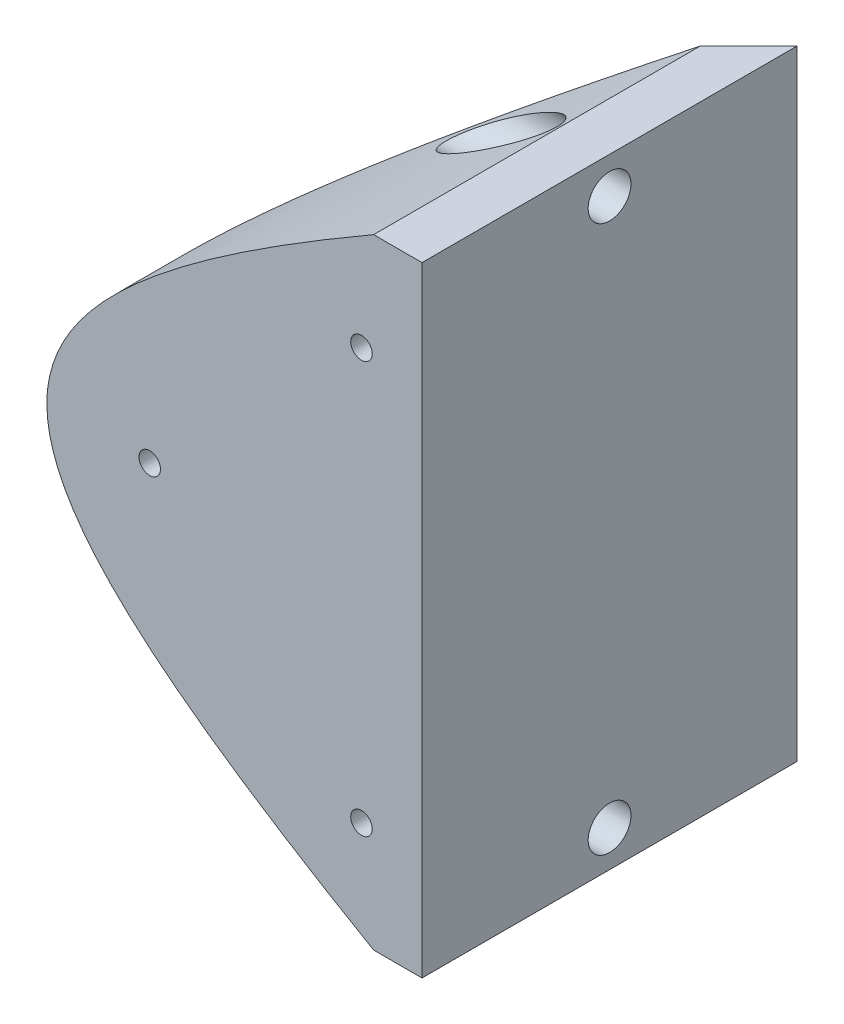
ISO-10303-21;
HEADER;
FILE_DESCRIPTION(('STEP AP214'),'2;1');
FILE_NAME('part.step','',(''),(''),'','','');
FILE_SCHEMA(('AUTOMOTIVE_DESIGN { 1 0 10303 214 1 1 1 1 }'));
ENDSEC;
DATA;
#1=APPLICATION_CONTEXT('core data for automotive mechanical design processes');
#2=APPLICATION_PROTOCOL_DEFINITION('international standard','automotive_design',2000,#1);
#3=PRODUCT_CONTEXT('',#1,'mechanical');
#4=PRODUCT('Part','Part','',(#3));
#5=PRODUCT_RELATED_PRODUCT_CATEGORY('part','',(#4));
#6=PRODUCT_DEFINITION_FORMATION('','',#4);
#7=PRODUCT_DEFINITION_CONTEXT('part definition',#1,'design');
#8=PRODUCT_DEFINITION('design','',#6,#7);
#9=PRODUCT_DEFINITION_SHAPE('','',#8);
#10=(LENGTH_UNIT() NAMED_UNIT(*) SI_UNIT(.MILLI.,.METRE.));
#11=(NAMED_UNIT(*) PLANE_ANGLE_UNIT() SI_UNIT($,.RADIAN.));
#12=(NAMED_UNIT(*) SI_UNIT($,.STERADIAN.) SOLID_ANGLE_UNIT());
#13=UNCERTAINTY_MEASURE_WITH_UNIT(LENGTH_MEASURE(1.E-05),#10,'distance_accuracy_value','');
#14=(GEOMETRIC_REPRESENTATION_CONTEXT(3) GLOBAL_UNCERTAINTY_ASSIGNED_CONTEXT((#13)) GLOBAL_UNIT_ASSIGNED_CONTEXT((#10,
#11,#12)) REPRESENTATION_CONTEXT('',''));
#15=CARTESIAN_POINT('',(0.,0.,0.));
#16=DIRECTION('',(0.,0.,1.));
#17=DIRECTION('',(1.,0.,0.));
#18=AXIS2_PLACEMENT_3D('',#15,#16,#17);
#19=CARTESIAN_POINT('',(-5.08,32.512,-39.37));
#20=CARTESIAN_POINT('',(-61.3924358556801,0.,-39.37));
#21=CARTESIAN_POINT('',(-5.08,-32.512,-39.37));
#22=(BOUNDED_CURVE() B_SPLINE_CURVE(2,(#19,#20,#21),.UNSPECIFIED.,.F.,
.F.) B_SPLINE_CURVE_WITH_KNOTS((3,3),(0.,1.),
.UNSPECIFIED.) CURVE() GEOMETRIC_REPRESENTATION_ITEM() RATIONAL_B_SPLINE_CURVE((1.,
1.5570484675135,1.)) REPRESENTATION_ITEM(''));
#23=DIRECTION('',(0.,0.,1.));
#24=VECTOR('',#23,1.);
#25=SURFACE_OF_LINEAR_EXTRUSION('',#22,#24);
#26=CARTESIAN_POINT('',(-5.08,32.512,-34.2900000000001));
#27=CARTESIAN_POINT('',(-5.67045751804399,32.1710885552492,-33.6995424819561));
#28=CARTESIAN_POINT('',(-6.26037439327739,31.8282982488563,-33.1096256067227));
#29=CARTESIAN_POINT('',(-7.4396270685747,31.1382006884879,-31.9303729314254));
#30=CARTESIAN_POINT('',(-8.028961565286,30.7908889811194,-31.3410384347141));
#31=CARTESIAN_POINT('',(-9.20676623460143,30.0914317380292,-30.1632337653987));
#32=CARTESIAN_POINT('',(-9.79523529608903,29.7392824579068,-29.5747647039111));
#33=CARTESIAN_POINT('',(-10.9710030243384,29.0297612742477,-28.3989969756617));
#34=CARTESIAN_POINT('',(-11.5583008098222,28.6723864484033,-27.811699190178));
#35=CARTESIAN_POINT('',(-12.7313999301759,27.9519577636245,-26.6386000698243));
#36=CARTESIAN_POINT('',(-13.3172006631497,27.5889019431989,-26.0527993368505));
#37=CARTESIAN_POINT('',(-14.4869529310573,26.8565669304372,-24.8830470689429));
#38=CARTESIAN_POINT('',(-15.0709041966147,26.4872868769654,-24.2990958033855));
#39=CARTESIAN_POINT('',(-16.2627289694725,25.725126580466,-23.1072710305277));
#40=CARTESIAN_POINT('',(-16.8705015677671,25.3319304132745,-22.4994984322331));
#41=CARTESIAN_POINT('',(-18.0831584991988,24.5371111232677,-21.2868415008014));
#42=CARTESIAN_POINT('',(-18.6880433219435,24.1354894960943,-20.6819566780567));
#43=CARTESIAN_POINT('',(-19.8943868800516,23.3227063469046,-19.4756131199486));
#44=CARTESIAN_POINT('',(-20.4958465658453,22.9115476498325,-18.874153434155));
#45=CARTESIAN_POINT('',(-21.6947124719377,22.0783163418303,-17.6752875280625));
#46=CARTESIAN_POINT('',(-22.2921200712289,21.6562477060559,-17.0778799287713));
#47=CARTESIAN_POINT('',(-23.4821313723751,20.7994742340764,-15.8878686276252));
#48=CARTESIAN_POINT('',(-24.0747366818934,20.3647738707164,-15.2952633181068));
#49=CARTESIAN_POINT('',(-25.2542431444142,19.480543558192,-14.115756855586));
#50=CARTESIAN_POINT('',(-25.8411455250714,19.031016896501,-13.5288544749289));
#51=CARTESIAN_POINT('',(-26.7711174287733,18.3004241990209,-12.5988825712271));
#52=CARTESIAN_POINT('',(-27.1164317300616,18.0250686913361,-12.2535682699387));
#53=CARTESIAN_POINT('',(-27.8042829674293,17.467394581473,-11.565717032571));
#54=CARTESIAN_POINT('',(-28.1468196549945,17.1850753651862,-11.2231803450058));
#55=CARTESIAN_POINT('',(-28.828740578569,16.6126037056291,-10.5412594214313));
#56=CARTESIAN_POINT('',(-29.1681238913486,16.3224490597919,-10.2018761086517));
#57=CARTESIAN_POINT('',(-29.8432860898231,15.7332499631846,-9.52671391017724));
#58=CARTESIAN_POINT('',(-30.179062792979,15.4342005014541,-9.19093720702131));
#59=CARTESIAN_POINT('',(-30.8464602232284,14.825919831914,-8.52353977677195));
#60=CARTESIAN_POINT('',(-31.1780764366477,14.5166786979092,-8.19192356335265));
#61=CARTESIAN_POINT('',(-31.8326010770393,13.8901080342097,-7.53739892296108));
#62=CARTESIAN_POINT('',(-32.1555636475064,13.5728919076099,-7.21443635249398));
#63=CARTESIAN_POINT('',(-32.7951323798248,12.925780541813,-6.57486762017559));
#64=CARTESIAN_POINT('',(-33.1117380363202,12.5958843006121,-6.25826196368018));
#65=CARTESIAN_POINT('',(-33.7368367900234,11.9217807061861,-5.63316320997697));
#66=CARTESIAN_POINT('',(-34.0453366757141,11.577585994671,-5.32466332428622));
#67=CARTESIAN_POINT('',(-34.6521610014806,10.8727103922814,-4.71783899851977));
#68=CARTESIAN_POINT('',(-34.9504978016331,10.5120508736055,-4.4195021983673));
#69=CARTESIAN_POINT('',(-35.5345343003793,9.77125982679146,-3.83546569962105));
#70=CARTESIAN_POINT('',(-35.8202432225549,9.39114296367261,-3.54975677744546));
#71=CARTESIAN_POINT('',(-36.3061651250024,8.70560316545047,-3.06383487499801));
#72=CARTESIAN_POINT('',(-36.5099200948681,8.405214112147,-2.86007990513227));
#73=CARTESIAN_POINT('',(-36.906185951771,7.78976028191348,-2.46381404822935));
#74=CARTESIAN_POINT('',(-37.0986945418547,7.47469253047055,-2.27130545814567));
#75=CARTESIAN_POINT('',(-37.4693990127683,6.82860349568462,-1.90060098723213));
#76=CARTESIAN_POINT('',(-37.6476115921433,6.49760156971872,-1.72238840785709));
#77=CARTESIAN_POINT('',(-37.9861994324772,5.81802785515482,-1.38380056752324));
#78=CARTESIAN_POINT('',(-38.1465819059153,5.4694632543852,-1.2234180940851));
#79=CARTESIAN_POINT('',(-38.5026177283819,4.61496994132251,-0.867382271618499));
#80=CARTESIAN_POINT('',(-38.6880553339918,4.10015015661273,-0.681944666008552));
#81=CARTESIAN_POINT('',(-38.9221371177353,3.30258699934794,-0.447862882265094));
#82=CARTESIAN_POINT('',(-38.9928006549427,3.0326146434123,-0.377199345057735));
#83=CARTESIAN_POINT('',(-39.1174690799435,2.48501306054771,-0.252530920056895));
#84=CARTESIAN_POINT('',(-39.171477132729,2.20738529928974,-0.198522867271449));
#85=CARTESIAN_POINT('',(-39.2543657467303,1.68750199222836,-0.115634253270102));
#86=CARTESIAN_POINT('',(-39.2857739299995,1.44605069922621,-0.0842260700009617));
#87=CARTESIAN_POINT('',(-39.3342056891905,0.960271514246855,-0.0357943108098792));
#88=CARTESIAN_POINT('',(-39.3512307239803,0.715943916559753,-0.0187692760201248));
#89=CARTESIAN_POINT('',(-39.3703637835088,0.226185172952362,0.000363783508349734));
#90=CARTESIAN_POINT('',(-39.372475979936,-0.0192456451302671,0.00247597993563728));
#91=CARTESIAN_POINT('',(-39.3617275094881,-0.509453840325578,-0.00827249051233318));
#92=CARTESIAN_POINT('',(-39.3488663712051,-0.754231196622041,-0.021133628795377));
#93=CARTESIAN_POINT('',(-39.3086313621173,-1.24069193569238,-0.0613686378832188));
#94=CARTESIAN_POINT('',(-39.2812971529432,-1.48238193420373,-0.0887028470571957));
#95=CARTESIAN_POINT('',(-39.2129460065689,-1.96183019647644,-0.157053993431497));
#96=CARTESIAN_POINT('',(-39.1719291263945,-2.19958847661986,-0.198070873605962));
#97=CARTESIAN_POINT('',(-39.0772802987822,-2.67009758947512,-0.29271970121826));
#98=CARTESIAN_POINT('',(-39.0236432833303,-2.90284636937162,-0.346356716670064));
#99=CARTESIAN_POINT('',(-38.904993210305,-3.36246357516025,-0.465006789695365));
#100=CARTESIAN_POINT('',(-38.8399787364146,-3.58933126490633,-0.530021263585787));
#101=CARTESIAN_POINT('',(-38.6935539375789,-4.05678861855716,-0.676446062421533));
#102=CARTESIAN_POINT('',(-38.6111957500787,-4.29678222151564,-0.758804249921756));
#103=CARTESIAN_POINT('',(-38.4360047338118,-4.76911927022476,-0.933995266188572));
#104=CARTESIAN_POINT('',(-38.3431660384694,-5.00145833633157,-1.02683396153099));
#105=CARTESIAN_POINT('',(-38.1484593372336,-5.45846839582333,-1.22154066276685));
#106=CARTESIAN_POINT('',(-38.0465895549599,-5.68313786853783,-1.32341044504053));
#107=CARTESIAN_POINT('',(-37.8347357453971,-6.12576022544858,-1.53526425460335));
#108=CARTESIAN_POINT('',(-37.7247256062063,-6.34368800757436,-1.64527439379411));
#109=CARTESIAN_POINT('',(-37.4980172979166,-6.77234325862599,-1.87198270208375));
#110=CARTESIAN_POINT('',(-37.381321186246,-6.98307291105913,-1.98867881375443));
#111=CARTESIAN_POINT('',(-37.1421435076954,-7.3978055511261,-2.22785649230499));
#112=CARTESIAN_POINT('',(-37.0196623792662,-7.60180904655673,-2.35033762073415));
#113=CARTESIAN_POINT('',(-36.6857946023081,-8.13839955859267,-2.68420539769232));
#114=CARTESIAN_POINT('',(-36.4699082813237,-8.4653963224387,-2.9000917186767));
#115=CARTESIAN_POINT('',(-36.0269157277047,-9.1041467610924,-3.34308427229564));
#116=CARTESIAN_POINT('',(-35.799801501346,-9.41588925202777,-3.57019849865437));
#117=CARTESIAN_POINT('',(-35.3363533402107,-10.0261345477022,-4.03364665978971));
#118=CARTESIAN_POINT('',(-35.1000083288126,-10.3246204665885,-4.26999167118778));
#119=CARTESIAN_POINT('',(-34.6198134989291,-10.9098128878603,-4.75018650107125));
#120=CARTESIAN_POINT('',(-34.3759574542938,-11.1965091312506,-4.99404254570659));
#121=CARTESIAN_POINT('',(-33.8822267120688,-11.7592310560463,-5.48777328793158));
#122=CARTESIAN_POINT('',(-33.6323526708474,-12.0352578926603,-5.73764732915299));
#123=CARTESIAN_POINT('',(-33.1247519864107,-12.580883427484,-6.24524801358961));
#124=CARTESIAN_POINT('',(-32.8669690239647,-12.8503770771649,-6.50303097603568));
#125=CARTESIAN_POINT('',(-32.3472968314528,-13.3805198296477,-7.02270316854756));
#126=CARTESIAN_POINT('',(-32.0854119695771,-13.6411775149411,-7.28458803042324));
#127=CARTESIAN_POINT('',(-31.5580710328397,-14.1546932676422,-7.81192896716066));
#128=CARTESIAN_POINT('',(-31.2926170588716,-14.407555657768,-8.07738294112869));
#129=CARTESIAN_POINT('',(-30.7585850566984,-14.9063393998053,-8.61141494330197));
#130=CARTESIAN_POINT('',(-30.4900079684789,-15.1522627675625,-8.87999203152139));
#131=CARTESIAN_POINT('',(-29.9501090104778,-15.6378817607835,-9.41989098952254));
#132=CARTESIAN_POINT('',(-29.6787875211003,-15.877578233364,-9.69121247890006));
#133=CARTESIAN_POINT('',(-29.0758903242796,-16.4016179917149,-10.2941096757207));
#134=CARTESIAN_POINT('',(-28.7437429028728,-16.6846452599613,-10.6262570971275));
#135=CARTESIAN_POINT('',(-28.0763673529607,-17.2433528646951,-11.2936326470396));
#136=CARTESIAN_POINT('',(-27.7411391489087,-17.5190330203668,-11.6288608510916));
#137=CARTESIAN_POINT('',(-27.0679263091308,-18.0638692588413,-12.3020736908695));
#138=CARTESIAN_POINT('',(-26.729940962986,-18.3330235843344,-12.6400590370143));
#139=CARTESIAN_POINT('',(-26.0516323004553,-18.86537957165,-13.318367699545));
#140=CARTESIAN_POINT('',(-25.7113089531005,-19.1285811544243,-13.6586910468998));
#141=CARTESIAN_POINT('',(-24.6868001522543,-19.9104691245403,-14.683199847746));
#142=CARTESIAN_POINT('',(-23.9995273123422,-20.4210756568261,-15.370472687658));
#143=CARTESIAN_POINT('',(-22.6179977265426,-21.4247743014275,-16.7520022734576));
#144=CARTESIAN_POINT('',(-21.9237361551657,-21.9178530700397,-17.4462638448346));
#145=CARTESIAN_POINT('',(-20.5295396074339,-22.8891973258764,-18.8404603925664));
#146=CARTESIAN_POINT('',(-19.8296014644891,-23.367453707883,-19.5403985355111));
#147=CARTESIAN_POINT('',(-18.4251531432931,-24.3112253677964,-20.9448468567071));
#148=CARTESIAN_POINT('',(-17.7206414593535,-24.7767361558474,-21.6493585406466));
#149=CARTESIAN_POINT('',(-16.3569192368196,-25.6647597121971,-23.0130807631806));
#150=CARTESIAN_POINT('',(-15.6979508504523,-26.0880174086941,-23.6720491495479));
#151=CARTESIAN_POINT('',(-14.3775362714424,-26.9259182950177,-24.9924637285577));
#152=CARTESIAN_POINT('',(-13.7160909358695,-27.3405641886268,-25.6539090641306));
#153=CARTESIAN_POINT('',(-12.3913828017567,-28.1620432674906,-26.9786171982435));
#154=CARTESIAN_POINT('',(-11.7281217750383,-28.5688821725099,-27.6418782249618));
#155=CARTESIAN_POINT('',(-10.4003947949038,-29.3753926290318,-28.9696052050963));
#156=CARTESIAN_POINT('',(-9.73593133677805,-29.7750724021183,-29.6340686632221));
#157=CARTESIAN_POINT('',(-8.40637742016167,-30.5677932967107,-30.9636225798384));
#158=CARTESIAN_POINT('',(-7.74129001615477,-30.9608446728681,-31.6287099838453));
#159=CARTESIAN_POINT('',(-6.41102774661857,-31.7407170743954,-32.9589722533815));
#160=CARTESIAN_POINT('',(-5.74585638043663,-32.1275500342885,-33.6241436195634));
#161=CARTESIAN_POINT('',(-5.08,-32.512,-34.2900000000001));
#162=B_SPLINE_CURVE_WITH_KNOTS('',3,(#26,#27,#28,#29,#30,#31,#32,#33,#34,#35,#36,#37,#38,#39,
#40,#41,#42,#43,#44,#45,#46,#47,#48,#49,#50,#51,#52,#53,#54,#55,#56,#57,#58,#59,#60,#61,#62,#63,
#64,#65,#66,#67,#68,#69,#70,#71,#72,#73,#74,#75,#76,#77,#78,#79,#80,#81,#82,#83,#84,#85,#86,#87,
#88,#89,#90,#91,#92,#93,#94,#95,#96,#97,#98,#99,#100,#101,#102,#103,#104,#105,#106,#107,#108,
#109,#110,#111,#112,#113,#114,#115,#116,#117,#118,#119,#120,#121,#122,#123,#124,#125,#126,#127,
#128,#129,#130,#131,#132,#133,#134,#135,#136,#137,#138,#139,#140,#141,#142,#143,#144,#145,#146,
#147,#148,#149,#150,#151,#152,#153,#154,#155,#156,#157,#158,#159,#160,#161),.UNSPECIFIED.,.F.,
.F.,(4,2,2,2,2,2,2,2,2,2,2,2,2,2,2,2,2,2,2,2,2,2,2,2,2,2,2,2,2,2,2,2,2,2,2,2,2,2,2,2,2,2,2,2,2,
2,2,2,2,2,2,2,2,2,2,2,2,2,2,2,2,2,2,2,2,2,2,4),(0.,2.70582945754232,5.41456325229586,
8.12552722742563,10.8380701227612,13.5515712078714,16.2654508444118,19.100970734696,
21.935991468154,24.7701829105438,27.6033558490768,30.4355375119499,33.2670953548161,
34.9489346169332,36.6309227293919,38.3133886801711,39.9968211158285,41.6819446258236,
43.3500290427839,45.0182455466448,46.6850172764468,48.349683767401,50.0131135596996,
51.2614070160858,52.5099545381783,53.7570217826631,55.0035827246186,56.7303851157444,
57.5931498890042,58.4557506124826,59.1914612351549,59.9270972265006,60.6625274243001,
61.3979807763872,62.1314290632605,62.8648742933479,63.5986145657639,64.3324462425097,
65.1321440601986,65.9322917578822,66.73259719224,67.5355914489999,68.3383399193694,
69.141027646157,70.4824241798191,71.824789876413,73.1688190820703,74.5139940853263,
75.8590230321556,77.2189482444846,78.5775123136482,79.9353089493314,81.2927069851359,
82.6499193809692,84.295056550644,85.940234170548,87.585849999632,89.2314876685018,
92.5249655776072,95.8208993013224,99.1188190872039,102.417886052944,105.488446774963,
108.558028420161,111.625267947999,114.688724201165,117.746900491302,120.798260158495),.UNSPECIFIED.);
#163=CARTESIAN_POINT('',(-39.3700000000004,0.,0.));
#164=VERTEX_POINT('',#163);
#165=CARTESIAN_POINT('',(-5.08,-32.512,-34.2900000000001));
#166=VERTEX_POINT('',#165);
#167=EDGE_CURVE('E58',#164,#166,#162,.T.);
#168=ORIENTED_EDGE('',*,*,#167,.T.);
#169=DIRECTION('',(0.,0.,1.));
#170=VECTOR('',#169,1.);
#171=CARTESIAN_POINT('',(-5.08,-32.512,-39.37));
#172=LINE('',#171,#170);
#173=CARTESIAN_POINT('',(-5.08,-32.512,0.));
#174=VERTEX_POINT('',#173);
#175=EDGE_CURVE('E13',#166,#174,#172,.T.);
#176=ORIENTED_EDGE('',*,*,#175,.T.);
#177=CARTESIAN_POINT('',(-5.08,32.512,0.));
#178=CARTESIAN_POINT('',(-61.3924358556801,0.,0.));
#179=CARTESIAN_POINT('',(-5.08,-32.512,0.));
#180=(BOUNDED_CURVE() B_SPLINE_CURVE(2,(#177,#178,#179),.UNSPECIFIED.,.F.,
.F.) B_SPLINE_CURVE_WITH_KNOTS((3,3),(0.,1.),
.UNSPECIFIED.) CURVE() GEOMETRIC_REPRESENTATION_ITEM() RATIONAL_B_SPLINE_CURVE((1.,
1.5570484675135,1.)) REPRESENTATION_ITEM(''));
#181=EDGE_CURVE('E196',#164,#174,#180,.T.);
#182=ORIENTED_EDGE('',*,*,#181,.F.);
#183=EDGE_LOOP('',(#168,#176,#182));
#184=FACE_BOUND('',#183,.T.);
#185=CARTESIAN_POINT('',(-11.5079949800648,-28.702,-16.129));
#186=CARTESIAN_POINT('',(-11.2513813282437,-28.8585674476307,-16.1289966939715));
#187=CARTESIAN_POINT('',(-10.9944678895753,-29.0147100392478,-16.1393115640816));
#188=CARTESIAN_POINT('',(-10.4812446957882,-29.3254717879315,-16.1805744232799));
#189=CARTESIAN_POINT('',(-10.2249352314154,-29.4800902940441,-16.21153087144));
#190=CARTESIAN_POINT('',(-9.71477400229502,-29.7867565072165,-16.2947714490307));
#191=CARTESIAN_POINT('',(-9.46091896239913,-29.9388079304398,-16.3470213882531));
#192=CARTESIAN_POINT('',(-8.95715768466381,-30.2395352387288,-16.4744242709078));
#193=CARTESIAN_POINT('',(-8.70724877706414,-30.3882134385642,-16.5495609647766));
#194=CARTESIAN_POINT('',(-8.25223137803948,-30.6580650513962,-16.7118335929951));
#195=CARTESIAN_POINT('',(-8.04621998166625,-30.7799086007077,-16.7952646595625));
#196=CARTESIAN_POINT('',(-7.7423061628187,-30.9592073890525,-16.936196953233));
#197=CARTESIAN_POINT('',(-7.64178460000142,-31.0184355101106,-16.9858449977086));
#198=CARTESIAN_POINT('',(-7.44290980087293,-31.1354719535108,-17.09086461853));
#199=CARTESIAN_POINT('',(-7.34455652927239,-31.1932802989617,-17.1462361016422));
#200=CARTESIAN_POINT('',(-7.14972104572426,-31.3076638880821,-17.2637533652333));
#201=CARTESIAN_POINT('',(-7.05326320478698,-31.364223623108,-17.3259549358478));
#202=CARTESIAN_POINT('',(-6.86387526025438,-31.4751505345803,-17.4574066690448));
#203=CARTESIAN_POINT('',(-6.7709461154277,-31.5295171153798,-17.5266587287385));
#204=CARTESIAN_POINT('',(-6.58994713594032,-31.6352963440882,-17.6727810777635));
#205=CARTESIAN_POINT('',(-6.50186489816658,-31.6867165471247,-17.7496303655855));
#206=CARTESIAN_POINT('',(-6.33182569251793,-31.7858854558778,-17.9119179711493));
#207=CARTESIAN_POINT('',(-6.24986371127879,-31.833637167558,-17.9973491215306));
#208=CARTESIAN_POINT('',(-6.09179211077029,-31.9256516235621,-18.1803386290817));
#209=CARTESIAN_POINT('',(-6.01591986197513,-31.9697737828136,-18.2781759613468));
#210=CARTESIAN_POINT('',(-5.8758466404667,-32.0511701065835,-18.4847955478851));
#211=CARTESIAN_POINT('',(-5.81164780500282,-32.0884430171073,-18.5935798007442));
#212=CARTESIAN_POINT('',(-5.72697041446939,-32.1375779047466,-18.7654546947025));
#213=CARTESIAN_POINT('',(-5.70053462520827,-32.1529121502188,-18.8246531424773));
#214=CARTESIAN_POINT('',(-5.65240544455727,-32.1808228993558,-18.9455605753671));
#215=CARTESIAN_POINT('',(-5.63070928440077,-32.1934010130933,-19.0072680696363));
#216=CARTESIAN_POINT('',(-5.59269835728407,-32.2154333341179,-19.1327564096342));
#217=CARTESIAN_POINT('',(-5.57637458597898,-32.2248927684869,-19.1965335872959));
#218=CARTESIAN_POINT('',(-5.54960953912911,-32.2404009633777,-19.3257194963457));
#219=CARTESIAN_POINT('',(-5.53916690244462,-32.2464505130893,-19.3911278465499));
#220=CARTESIAN_POINT('',(-5.52548869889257,-32.2543740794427,-19.5144420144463));
#221=CARTESIAN_POINT('',(-5.52150215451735,-32.2566831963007,-19.5722373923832));
#222=CARTESIAN_POINT('',(-5.51841782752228,-32.2584697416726,-19.6879997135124));
#223=CARTESIAN_POINT('',(-5.51931956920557,-32.2579474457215,-19.745966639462));
#224=CARTESIAN_POINT('',(-5.52598652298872,-32.2540856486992,-19.8615402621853));
#225=CARTESIAN_POINT('',(-5.53175299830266,-32.2507454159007,-19.9191468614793));
#226=CARTESIAN_POINT('',(-5.54796829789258,-32.2413515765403,-20.0334550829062));
#227=CARTESIAN_POINT('',(-5.55841706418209,-32.235298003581,-20.0901567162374));
#228=CARTESIAN_POINT('',(-5.59325968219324,-32.2151083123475,-20.2444627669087));
#229=CARTESIAN_POINT('',(-5.62222986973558,-32.198318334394,-20.3407223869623));
#230=CARTESIAN_POINT('',(-5.69158955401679,-32.1581016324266,-20.5274099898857));
#231=CARTESIAN_POINT('',(-5.73198104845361,-32.1346737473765,-20.617836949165));
#232=CARTESIAN_POINT('',(-5.85085626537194,-32.0656838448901,-20.8482230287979));
#233=CARTESIAN_POINT('',(-5.93716705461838,-32.0155564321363,-20.9828068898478));
#234=CARTESIAN_POINT('',(-6.07911919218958,-31.933014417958,-21.1717555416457));
#235=CARTESIAN_POINT('',(-6.128625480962,-31.9042123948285,-21.2326891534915));
#236=CARTESIAN_POINT('',(-6.23111710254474,-31.8445476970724,-21.3504967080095));
#237=CARTESIAN_POINT('',(-6.28410175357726,-31.8136854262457,-21.4073714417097));
#238=CARTESIAN_POINT('',(-6.43223718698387,-31.7273435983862,-21.5570046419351));
#239=CARTESIAN_POINT('',(-6.53019998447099,-31.6701852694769,-21.6460072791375));
#240=CARTESIAN_POINT('',(-6.73230491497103,-31.5521171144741,-21.813968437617));
#241=CARTESIAN_POINT('',(-6.83645161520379,-31.4912045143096,-21.8929193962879));
#242=CARTESIAN_POINT('',(-7.04947045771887,-31.3664523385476,-22.041965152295));
#243=CARTESIAN_POINT('',(-7.15834933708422,-31.3026085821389,-22.1120467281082));
#244=CARTESIAN_POINT('',(-7.37961740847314,-31.1726844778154,-22.2441873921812));
#245=CARTESIAN_POINT('',(-7.49200786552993,-31.1066033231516,-22.306243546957));
#246=CARTESIAN_POINT('',(-7.71195356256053,-30.9770991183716,-22.419217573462));
#247=CARTESIAN_POINT('',(-7.8193378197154,-30.9137888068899,-22.4706004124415));
#248=CARTESIAN_POINT('',(-8.03597448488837,-30.7858909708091,-22.5675279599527));
#249=CARTESIAN_POINT('',(-8.14522720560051,-30.7213032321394,-22.6130716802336));
#250=CARTESIAN_POINT('',(-8.47533316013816,-30.5258747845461,-22.7416304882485));
#251=CARTESIAN_POINT('',(-8.69843143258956,-30.3934293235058,-22.8165216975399));
#252=CARTESIAN_POINT('',(-9.14867671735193,-30.1253294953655,-22.9471330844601));
#253=CARTESIAN_POINT('',(-9.37582966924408,-29.9896703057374,-23.0028222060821));
#254=CARTESIAN_POINT('',(-9.83235769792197,-29.7161654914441,-23.0963750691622));
#255=CARTESIAN_POINT('',(-10.0617320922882,-29.5783205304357,-23.1342441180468));
#256=CARTESIAN_POINT('',(-10.5416350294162,-29.2889712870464,-23.1956030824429));
#257=CARTESIAN_POINT('',(-10.7922707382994,-29.1373204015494,-23.2175586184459));
#258=CARTESIAN_POINT('',(-11.2937883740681,-28.8327420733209,-23.2418784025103));
#259=CARTESIAN_POINT('',(-11.5446703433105,-28.6798143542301,-23.244238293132));
#260=CARTESIAN_POINT('',(-12.0450294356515,-28.3736394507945,-23.2291173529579));
#261=CARTESIAN_POINT('',(-12.2945082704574,-28.2203933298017,-23.2116720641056));
#262=CARTESIAN_POINT('',(-12.791206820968,-27.9140752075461,-23.1561014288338));
#263=CARTESIAN_POINT('',(-13.0384273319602,-27.7610031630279,-23.1179836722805));
#264=CARTESIAN_POINT('',(-13.4398979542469,-27.511409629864,-23.0373160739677));
#265=CARTESIAN_POINT('',(-13.5952897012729,-27.4145497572,-23.0014091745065));
#266=CARTESIAN_POINT('',(-13.9039942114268,-27.2216191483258,-22.9199002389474));
#267=CARTESIAN_POINT('',(-14.0573073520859,-27.1255482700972,-22.8742999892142));
#268=CARTESIAN_POINT('',(-14.3612452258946,-26.9345850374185,-22.7725702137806));
#269=CARTESIAN_POINT('',(-14.5118690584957,-26.8396930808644,-22.716437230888));
#270=CARTESIAN_POINT('',(-14.8094484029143,-26.651720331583,-22.5926039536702));
#271=CARTESIAN_POINT('',(-14.9564048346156,-26.5586390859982,-22.5249065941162));
#272=CARTESIAN_POINT('',(-15.2077610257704,-26.3990106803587,-22.3959007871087));
#273=CARTESIAN_POINT('',(-15.3132805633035,-26.331863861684,-22.3375166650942));
#274=CARTESIAN_POINT('',(-15.5209373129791,-26.199466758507,-22.2129888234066));
#275=CARTESIAN_POINT('',(-15.6230740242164,-26.1342167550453,-22.1468439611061));
#276=CARTESIAN_POINT('',(-15.8228127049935,-26.0063724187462,-22.0061520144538));
#277=CARTESIAN_POINT('',(-15.9204229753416,-25.9437732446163,-21.9316212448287));
#278=CARTESIAN_POINT('',(-16.1099688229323,-25.8219937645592,-21.7732227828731));
#279=CARTESIAN_POINT('',(-16.2019078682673,-25.7628113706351,-21.6893608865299));
#280=CARTESIAN_POINT('',(-16.3932960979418,-25.6394023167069,-21.4963204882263));
#281=CARTESIAN_POINT('',(-16.4914087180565,-25.5760007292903,-21.3852561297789));
#282=CARTESIAN_POINT('',(-16.673530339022,-25.458106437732,-21.1478134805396));
#283=CARTESIAN_POINT('',(-16.7575562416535,-25.4036030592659,-21.0214538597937));
#284=CARTESIAN_POINT('',(-16.8909883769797,-25.3169340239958,-20.7801550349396));
#285=CARTESIAN_POINT('',(-16.9439591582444,-25.2824801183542,-20.6680630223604));
#286=CARTESIAN_POINT('',(-17.0113938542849,-25.2385836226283,-20.4933926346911));
#287=CARTESIAN_POINT('',(-17.0318703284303,-25.225247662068,-20.4340725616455));
#288=CARTESIAN_POINT('',(-17.0683971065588,-25.2014503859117,-20.3135345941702));
#289=CARTESIAN_POINT('',(-17.0844494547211,-25.1909877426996,-20.2523175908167));
#290=CARTESIAN_POINT('',(-17.1118798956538,-25.1731048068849,-20.1277554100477));
#291=CARTESIAN_POINT('',(-17.1232102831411,-25.1657155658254,-20.0643951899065));
#292=CARTESIAN_POINT('',(-17.1406555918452,-25.1543369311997,-19.9366608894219));
#293=CARTESIAN_POINT('',(-17.1467711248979,-25.1503471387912,-19.872286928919));
#294=CARTESIAN_POINT('',(-17.15360326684,-25.1458897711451,-19.7431674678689));
#295=CARTESIAN_POINT('',(-17.1543233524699,-25.1454199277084,-19.6784222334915));
#296=CARTESIAN_POINT('',(-17.150359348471,-25.1480061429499,-19.5491614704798));
#297=CARTESIAN_POINT('',(-17.1456734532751,-25.1510633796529,-19.4846460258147));
#298=CARTESIAN_POINT('',(-17.1257749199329,-25.1640434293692,-19.3107198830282));
#299=CARTESIAN_POINT('',(-17.1054386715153,-25.1773073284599,-19.2020990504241));
#300=CARTESIAN_POINT('',(-17.050798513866,-25.2129191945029,-18.9899681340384));
#301=CARTESIAN_POINT('',(-17.0164780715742,-25.2352779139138,-18.8864642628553));
#302=CARTESIAN_POINT('',(-16.9482174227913,-25.279704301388,-18.7163531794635));
#303=CARTESIAN_POINT('',(-16.9172593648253,-25.29984220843,-18.6480015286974));
#304=CARTESIAN_POINT('',(-16.850410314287,-25.3432943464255,-18.5149032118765));
#305=CARTESIAN_POINT('',(-16.8145238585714,-25.3666056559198,-18.4501533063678));
#306=CARTESIAN_POINT('',(-16.7384305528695,-25.4159938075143,-18.3241581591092));
#307=CARTESIAN_POINT('',(-16.6982142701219,-25.442076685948,-18.2629210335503));
#308=CARTESIAN_POINT('',(-16.6141505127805,-25.4965486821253,-18.1440611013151));
#309=CARTESIAN_POINT('',(-16.5703018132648,-25.524938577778,-18.0864395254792));
#310=CARTESIAN_POINT('',(-16.4538339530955,-25.6002739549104,-17.9431036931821));
#311=CARTESIAN_POINT('',(-16.3789751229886,-25.6486288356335,-17.8599434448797));
#312=CARTESIAN_POINT('',(-16.2233954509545,-25.7489627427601,-17.7016970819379));
#313=CARTESIAN_POINT('',(-16.1426716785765,-25.8009435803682,-17.6266150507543));
#314=CARTESIAN_POINT('',(-15.9764939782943,-25.9077714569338,-17.4837754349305));
#315=CARTESIAN_POINT('',(-15.8910320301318,-25.9626233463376,-17.4160308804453));
#316=CARTESIAN_POINT('',(-15.7164362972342,-26.0744907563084,-17.2873772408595));
#317=CARTESIAN_POINT('',(-15.6273011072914,-26.1315071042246,-17.2264708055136));
#318=CARTESIAN_POINT('',(-15.3763736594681,-26.2917337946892,-17.06646566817));
#319=CARTESIAN_POINT('',(-15.2114493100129,-26.3967306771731,-16.9740407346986));
#320=CARTESIAN_POINT('',(-14.8752234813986,-26.6101066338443,-16.8061914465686));
#321=CARTESIAN_POINT('',(-14.7039171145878,-26.7184882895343,-16.7307804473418));
#322=CARTESIAN_POINT('',(-14.3566977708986,-26.9374749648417,-16.5949855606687));
#323=CARTESIAN_POINT('',(-14.1807817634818,-27.0480814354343,-16.5346118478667));
#324=CARTESIAN_POINT('',(-13.8257777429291,-27.2705951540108,-16.4274771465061));
#325=CARTESIAN_POINT('',(-13.6466906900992,-27.38250200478,-16.3807121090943));
#326=CARTESIAN_POINT('',(-13.3057208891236,-27.5949156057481,-16.3040496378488));
#327=CARTESIAN_POINT('',(-13.1440737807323,-27.6953454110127,-16.2728744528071));
#328=CARTESIAN_POINT('',(-12.8194160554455,-27.8965145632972,-16.2198664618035));
#329=CARTESIAN_POINT('',(-12.6564052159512,-27.9972539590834,-16.1980352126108));
#330=CARTESIAN_POINT('',(-12.3294622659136,-28.1987749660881,-16.1633022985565));
#331=CARTESIAN_POINT('',(-12.1655301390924,-28.2995565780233,-16.1504007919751));
#332=CARTESIAN_POINT('',(-11.837104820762,-28.5009504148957,-16.1332503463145));
#333=CARTESIAN_POINT('',(-11.6726115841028,-28.6015626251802,-16.1290021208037));
#334=CARTESIAN_POINT('',(-11.5079949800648,-28.702,-16.129));
#335=B_SPLINE_CURVE_WITH_KNOTS('',3,(#185,#186,#187,#188,#189,#190,#191,#192,#193,#194,#195,
#196,#197,#198,#199,#200,#201,#202,#203,#204,#205,#206,#207,#208,#209,#210,#211,#212,#213,#214,
#215,#216,#217,#218,#219,#220,#221,#222,#223,#224,#225,#226,#227,#228,#229,#230,#231,#232,#233,
#234,#235,#236,#237,#238,#239,#240,#241,#242,#243,#244,#245,#246,#247,#248,#249,#250,#251,#252,
#253,#254,#255,#256,#257,#258,#259,#260,#261,#262,#263,#264,#265,#266,#267,#268,#269,#270,#271,
#272,#273,#274,#275,#276,#277,#278,#279,#280,#281,#282,#283,#284,#285,#286,#287,#288,#289,#290,
#291,#292,#293,#294,#295,#296,#297,#298,#299,#300,#301,#302,#303,#304,#305,#306,#307,#308,#309,
#310,#311,#312,#313,#314,#315,#316,#317,#318,#319,#320,#321,#322,#323,#324,#325,#326,#327,#328,
#329,#330,#331,#332,#333,#334),.UNSPECIFIED.,.T.,.F.,(4,2,2,2,2,2,2,2,2,2,2,2,2,2,2,2,2,2,2,2,2,
2,2,2,2,2,2,2,2,2,2,2,2,2,2,2,2,2,2,2,2,2,2,2,2,2,2,2,2,2,2,2,2,2,2,2,2,2,2,2,2,2,2,2,2,2,2,2,2,
2,2,2,2,2,4),(0.,0.901703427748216,1.80377660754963,2.70440703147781,3.60439949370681,
4.36387991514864,4.74414454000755,5.12440297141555,5.50803814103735,5.89177681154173,
6.27448287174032,6.65687192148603,7.05030413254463,7.44380830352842,7.64344768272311,
7.8429701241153,8.04215643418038,8.24129662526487,8.41496598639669,8.58861844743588,
8.76231601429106,8.93601143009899,9.24047706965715,9.54499599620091,10.0445768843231,
10.295339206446,10.5460525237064,10.9778675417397,11.4100055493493,11.8427803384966,
12.2757128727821,12.6800487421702,13.0844529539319,13.8936496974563,14.7041491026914,
15.5144069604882,16.3950321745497,17.2758532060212,18.1550960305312,19.0340162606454,
19.5935776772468,20.1530360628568,20.7126784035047,21.272178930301,21.6860327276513,
22.0999475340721,22.5130705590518,22.9259383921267,23.4082276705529,23.8899340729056,
24.274358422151,24.4666190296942,24.6587906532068,24.8528592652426,25.0469051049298,
25.2408258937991,25.4348114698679,25.7671191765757,26.0998209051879,26.332590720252,
26.5651476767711,26.7982219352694,27.031375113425,27.3964618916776,27.7617323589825,
28.1276412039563,28.4936913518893,29.141405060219,29.7896254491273,30.4382832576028,
31.0867478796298,31.6650326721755,32.2434137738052,32.8218051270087,33.4002441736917),.UNSPECIFIED.);
#336=CARTESIAN_POINT('',(-11.5079949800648,-28.702,-16.129));
#337=VERTEX_POINT('',#336);
#338=EDGE_CURVE('E41',#337,#337,#335,.T.);
#339=ORIENTED_EDGE('',*,*,#338,.T.);
#340=EDGE_LOOP('',(#339));
#341=FACE_BOUND('',#340,.T.);
#342=ADVANCED_FACE('F37',(#184,#341),#25,.T.);
#343=CARTESIAN_POINT('',(-5.08,32.512,-34.2900000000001));
#344=VERTEX_POINT('',#343);
#345=EDGE_CURVE('E220',#344,#164,#162,.T.);
#346=ORIENTED_EDGE('',*,*,#345,.T.);
#347=CARTESIAN_POINT('',(-5.08,32.512,0.));
#348=VERTEX_POINT('',#347);
#349=EDGE_CURVE('E201',#348,#164,#180,.T.);
#350=ORIENTED_EDGE('',*,*,#349,.F.);
#351=DIRECTION('',(0.,0.,1.));
#352=VECTOR('',#351,1.);
#353=CARTESIAN_POINT('',(-5.08,32.512,-39.37));
#354=LINE('',#353,#352);
#355=EDGE_CURVE('E209',#344,#348,#354,.T.);
#356=ORIENTED_EDGE('',*,*,#355,.F.);
#357=EDGE_LOOP('',(#346,#350,#356));
#358=FACE_BOUND('',#357,.T.);
#359=CARTESIAN_POINT('',(-11.5079949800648,28.702,-16.129));
#360=CARTESIAN_POINT('',(-11.7649745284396,28.5452090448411,-16.1289966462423));
#361=CARTESIAN_POINT('',(-12.0217179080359,28.3879526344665,-16.1393404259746));
#362=CARTESIAN_POINT('',(-12.5334668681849,28.0732380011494,-16.1814287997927));
#363=CARTESIAN_POINT('',(-12.7884717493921,27.9157797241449,-16.2131815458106));
#364=CARTESIAN_POINT('',(-13.2946908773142,27.6019026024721,-16.2995340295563));
#365=CARTESIAN_POINT('',(-13.5459108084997,27.4454824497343,-16.3540950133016));
#366=CARTESIAN_POINT('',(-14.0429391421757,27.1346962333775,-16.4885336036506));
#367=CARTESIAN_POINT('',(-14.2887474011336,26.9803302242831,-16.568411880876));
#368=CARTESIAN_POINT('',(-14.7228757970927,26.7065314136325,-16.7381940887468));
#369=CARTESIAN_POINT('',(-14.9127639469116,26.586350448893,-16.8227987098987));
#370=CARTESIAN_POINT('',(-15.1913752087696,26.4094185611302,-16.9656387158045));
#371=CARTESIAN_POINT('',(-15.2831727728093,26.3510209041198,-17.0158839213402));
#372=CARTESIAN_POINT('',(-15.4642650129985,26.2356235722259,-17.1221346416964));
#373=CARTESIAN_POINT('',(-15.5535602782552,26.1786235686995,-17.1781387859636));
#374=CARTESIAN_POINT('',(-15.7300796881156,26.0657589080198,-17.2970791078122));
#375=CARTESIAN_POINT('',(-15.8172689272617,26.0099144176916,-17.3600866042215));
#376=CARTESIAN_POINT('',(-15.9876901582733,25.9005824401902,-17.4930597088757));
#377=CARTESIAN_POINT('',(-16.0709238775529,25.8470939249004,-17.5630222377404));
#378=CARTESIAN_POINT('',(-16.2322697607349,25.7432468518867,-17.7104047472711));
#379=CARTESIAN_POINT('',(-16.3103922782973,25.6928819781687,-17.7878088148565));
#380=CARTESIAN_POINT('',(-16.4602727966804,25.5961152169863,-17.9507610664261));
#381=CARTESIAN_POINT('',(-16.5320354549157,25.5497104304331,-18.036303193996));
#382=CARTESIAN_POINT('',(-16.6761761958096,25.4563808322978,-18.2276582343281));
#383=CARTESIAN_POINT('',(-16.7474476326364,25.4101559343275,-18.3346633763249));
#384=CARTESIAN_POINT('',(-16.876269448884,25.3265041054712,-18.5600342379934));
#385=CARTESIAN_POINT('',(-16.9338249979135,25.2890738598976,-18.6783956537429));
#386=CARTESIAN_POINT('',(-17.0070398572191,25.2414191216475,-18.8642123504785));
#387=CARTESIAN_POINT('',(-17.0293631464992,25.2268809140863,-18.927987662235));
#388=CARTESIAN_POINT('',(-17.0688814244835,25.2011350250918,-19.0577470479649));
#389=CARTESIAN_POINT('',(-17.0860793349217,25.1899254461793,-19.1237298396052));
#390=CARTESIAN_POINT('',(-17.1148545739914,25.1711651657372,-19.2573458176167));
#391=CARTESIAN_POINT('',(-17.1264383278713,25.1636102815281,-19.3249770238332));
#392=CARTESIAN_POINT('',(-17.1436493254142,25.1523839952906,-19.4613116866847));
#393=CARTESIAN_POINT('',(-17.1492776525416,25.148711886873,-19.5300149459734));
#394=CARTESIAN_POINT('',(-17.1540290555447,25.1456119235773,-19.6579312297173));
#395=CARTESIAN_POINT('',(-17.1539640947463,25.1456543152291,-19.7171030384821));
#396=CARTESIAN_POINT('',(-17.1493220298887,25.148682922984,-19.8352137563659));
#397=CARTESIAN_POINT('',(-17.1447434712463,25.1516700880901,-19.8941525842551));
#398=CARTESIAN_POINT('',(-17.1311839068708,25.1605150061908,-20.011296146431));
#399=CARTESIAN_POINT('',(-17.1222033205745,25.1663724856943,-20.0695009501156));
#400=CARTESIAN_POINT('',(-17.100054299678,25.1808148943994,-20.1847725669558));
#401=CARTESIAN_POINT('',(-17.086884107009,25.1894009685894,-20.2418388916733));
#402=CARTESIAN_POINT('',(-17.043167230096,25.2178912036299,-20.4045540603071));
#403=CARTESIAN_POINT('',(-17.0075782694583,25.241073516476,-20.5083205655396));
#404=CARTESIAN_POINT('',(-16.9246570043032,25.2950340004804,-20.7090010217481));
#405=CARTESIAN_POINT('',(-16.8773019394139,25.32582689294,-20.8059012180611));
#406=CARTESIAN_POINT('',(-16.7389738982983,25.4156674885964,-21.0532291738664));
#407=CARTESIAN_POINT('',(-16.6397439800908,25.4800136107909,-21.1971596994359));
#408=CARTESIAN_POINT('',(-16.4778611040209,25.5847357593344,-21.3977534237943));
#409=CARTESIAN_POINT('',(-16.4216342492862,25.6210701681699,-21.4621515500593));
#410=CARTESIAN_POINT('',(-16.3055227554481,25.6960128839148,-21.5861613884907));
#411=CARTESIAN_POINT('',(-16.2456388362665,25.7346207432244,-21.6457740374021));
#412=CARTESIAN_POINT('',(-16.0816412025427,25.8402196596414,-21.7989832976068));
#413=CARTESIAN_POINT('',(-15.9748181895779,25.9088686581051,-21.8885345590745));
#414=CARTESIAN_POINT('',(-15.7551465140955,26.049728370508,-22.0561928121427));
#415=CARTESIAN_POINT('',(-15.642306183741,26.1219341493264,-22.1343150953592));
#416=CARTESIAN_POINT('',(-15.411694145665,26.2691712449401,-22.2806261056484));
#417=CARTESIAN_POINT('',(-15.2939117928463,26.3442086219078,-22.3487918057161));
#418=CARTESIAN_POINT('',(-15.0547195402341,26.4962505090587,-22.4759894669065));
#419=CARTESIAN_POINT('',(-14.9333083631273,26.5732557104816,-22.535018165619));
#420=CARTESIAN_POINT('',(-14.5925041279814,26.7889214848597,-22.687306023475));
#421=CARTESIAN_POINT('',(-14.3700805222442,26.9291247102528,-22.7716505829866));
#422=CARTESIAN_POINT('',(-13.9194712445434,27.2120288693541,-22.9177146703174));
#423=CARTESIAN_POINT('',(-13.6912822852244,27.3547312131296,-22.979420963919));
#424=CARTESIAN_POINT('',(-13.230680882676,27.6416546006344,-23.08265928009));
#425=CARTESIAN_POINT('',(-12.9982605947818,27.7858781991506,-23.1241487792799));
#426=CARTESIAN_POINT('',(-12.531150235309,28.0746348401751,-23.188342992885));
#427=CARTESIAN_POINT('',(-12.2964606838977,28.2191678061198,-23.2110519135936));
#428=CARTESIAN_POINT('',(-11.8080767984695,28.5188355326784,-23.2397046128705));
#429=CARTESIAN_POINT('',(-11.5542861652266,28.6739463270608,-23.2442522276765));
#430=CARTESIAN_POINT('',(-11.0464484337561,28.9831494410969,-23.2332428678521));
#431=CARTESIAN_POINT('',(-10.7924012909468,29.1372415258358,-23.2176814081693));
#432=CARTESIAN_POINT('',(-10.2861556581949,29.4431918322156,-23.1663437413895));
#433=CARTESIAN_POINT('',(-10.0339538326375,29.5950557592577,-23.1306346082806));
#434=CARTESIAN_POINT('',(-9.53198676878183,29.8962756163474,-23.0381587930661));
#435=CARTESIAN_POINT('',(-9.28222051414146,30.0456326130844,-22.981401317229));
#436=CARTESIAN_POINT('',(-8.89907477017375,30.2740025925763,-22.8758993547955));
#437=CARTESIAN_POINT('',(-8.76419649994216,30.3542496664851,-22.8351603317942));
#438=CARTESIAN_POINT('',(-8.49611416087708,30.5134713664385,-22.7463757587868));
#439=CARTESIAN_POINT('',(-8.36290982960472,30.5924461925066,-22.6983313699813));
#440=CARTESIAN_POINT('',(-8.09814876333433,30.7491565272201,-22.5941536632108));
#441=CARTESIAN_POINT('',(-7.96660062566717,30.8268859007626,-22.5379891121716));
#442=CARTESIAN_POINT('',(-7.70638919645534,30.980392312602,-22.4169625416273));
#443=CARTESIAN_POINT('',(-7.57772564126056,31.0561695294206,-22.3521013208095));
#444=CARTESIAN_POINT('',(-7.32221377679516,31.2064237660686,-22.2116081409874));
#445=CARTESIAN_POINT('',(-7.19542620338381,31.2808613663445,-22.1358222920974));
#446=CARTESIAN_POINT('',(-6.94711196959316,31.4264336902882,-21.9729123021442));
#447=CARTESIAN_POINT('',(-6.82558915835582,31.4975660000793,-21.8857800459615));
#448=CARTESIAN_POINT('',(-6.59083596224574,31.6347899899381,-21.6992504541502));
#449=CARTESIAN_POINT('',(-6.47755407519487,31.7009131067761,-21.5999420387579));
#450=CARTESIAN_POINT('',(-6.26170688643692,31.8267512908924,-21.3868629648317));
#451=CARTESIAN_POINT('',(-6.15911959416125,31.8864795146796,-21.2731230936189));
#452=CARTESIAN_POINT('',(-5.99311626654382,31.9830313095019,-21.0597867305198));
#453=CARTESIAN_POINT('',(-5.92631516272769,32.0218503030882,-20.9637491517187));
#454=CARTESIAN_POINT('',(-5.80435418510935,32.0926781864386,-20.7619569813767));
#455=CARTESIAN_POINT('',(-5.749195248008,32.1246865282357,-20.6562016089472));
#456=CARTESIAN_POINT('',(-5.67778236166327,32.1661077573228,-20.4902374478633));
#457=CARTESIAN_POINT('',(-5.65576234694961,32.1788761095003,-20.4333073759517));
#458=CARTESIAN_POINT('',(-5.61620300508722,32.2018101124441,-20.3174146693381));
#459=CARTESIAN_POINT('',(-5.59866124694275,32.211977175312,-20.2584531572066));
#460=CARTESIAN_POINT('',(-5.5685519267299,32.2294258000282,-20.1389237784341));
#461=CARTESIAN_POINT('',(-5.5559784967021,32.2367107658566,-20.0783578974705));
#462=CARTESIAN_POINT('',(-5.53617331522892,32.2481848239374,-19.9560679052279));
#463=CARTESIAN_POINT('',(-5.52894072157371,32.252374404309,-19.8943439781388));
#464=CARTESIAN_POINT('',(-5.52052773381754,32.2572476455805,-19.776855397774));
#465=CARTESIAN_POINT('',(-5.51879313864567,32.2582523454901,-19.7211431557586));
#466=CARTESIAN_POINT('',(-5.51985002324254,32.257640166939,-19.6097557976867));
#467=CARTESIAN_POINT('',(-5.52264306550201,32.2560223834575,-19.5540807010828));
#468=CARTESIAN_POINT('',(-5.53268010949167,32.2502082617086,-19.4432748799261));
#469=CARTESIAN_POINT('',(-5.53992376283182,32.2460121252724,-19.3881441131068));
#470=CARTESIAN_POINT('',(-5.55866011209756,32.2351570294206,-19.2788475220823));
#471=CARTESIAN_POINT('',(-5.57015463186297,32.2284970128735,-19.2246821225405));
#472=CARTESIAN_POINT('',(-5.60834151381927,32.2063673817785,-19.0731756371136));
#473=CARTESIAN_POINT('',(-5.63972429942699,32.1881769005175,-18.9773758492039));
#474=CARTESIAN_POINT('',(-5.71360728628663,32.1453311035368,-18.7918546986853));
#475=CARTESIAN_POINT('',(-5.75611004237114,32.1206743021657,-18.7021347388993));
#476=CARTESIAN_POINT('',(-5.88235085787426,32.0473952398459,-18.4697314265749));
#477=CARTESIAN_POINT('',(-5.97435365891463,31.9939482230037,-18.3330233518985));
#478=CARTESIAN_POINT('',(-6.12496198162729,31.9063440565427,-18.1415357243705));
#479=CARTESIAN_POINT('',(-6.17740621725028,31.8758216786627,-18.0798376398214));
#480=CARTESIAN_POINT('',(-6.28578667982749,31.8127036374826,-17.9607051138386));
#481=CARTESIAN_POINT('',(-6.34172219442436,31.7801083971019,-17.903269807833));
#482=CARTESIAN_POINT('',(-6.49901960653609,31.6883832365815,-17.7512469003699));
#483=CARTESIAN_POINT('',(-6.60328736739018,31.6275129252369,-17.6607197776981));
#484=CARTESIAN_POINT('',(-6.8178087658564,31.5021126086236,-17.4905415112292));
#485=CARTESIAN_POINT('',(-6.92805172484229,31.43758912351,-17.4108718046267));
#486=CARTESIAN_POINT('',(-7.15345156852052,31.3054827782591,-17.2607396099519));
#487=CARTESIAN_POINT('',(-7.2686225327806,31.2378911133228,-17.1903062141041));
#488=CARTESIAN_POINT('',(-7.50248038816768,31.1004441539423,-17.0578894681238));
#489=CARTESIAN_POINT('',(-7.62116903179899,31.0305877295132,-16.9959104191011));
#490=CARTESIAN_POINT('',(-7.85288488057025,30.8940001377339,-16.8836551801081));
#491=CARTESIAN_POINT('',(-7.96573493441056,30.8273875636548,-16.832865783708));
#492=CARTESIAN_POINT('',(-8.19326091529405,30.692889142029,-16.7374092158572));
#493=CARTESIAN_POINT('',(-8.30793714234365,30.6250030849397,-16.6927430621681));
#494=CARTESIAN_POINT('',(-8.65421784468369,30.4197038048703,-16.5672418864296));
#495=CARTESIAN_POINT('',(-8.88800157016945,30.2806923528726,-16.4949385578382));
#496=CARTESIAN_POINT('',(-9.35884652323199,29.9998291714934,-16.3707422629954));
#497=CARTESIAN_POINT('',(-9.59590482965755,29.8579799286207,-16.3188321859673));
#498=CARTESIAN_POINT('',(-10.0719560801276,29.572176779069,-16.2338932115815));
#499=CARTESIAN_POINT('',(-10.3109479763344,29.4282239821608,-16.2008547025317));
#500=CARTESIAN_POINT('',(-10.7097507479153,29.1871806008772,-16.160903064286));
#501=CARTESIAN_POINT('',(-10.8693306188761,29.0905069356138,-16.1489488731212));
#502=CARTESIAN_POINT('',(-11.1886356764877,28.8966155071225,-16.1329969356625));
#503=CARTESIAN_POINT('',(-11.3483608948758,28.7993975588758,-16.1290020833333));
#504=CARTESIAN_POINT('',(-11.5079949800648,28.702,-16.129));
#505=B_SPLINE_CURVE_WITH_KNOTS('',3,(#359,#360,#361,#362,#363,#364,#365,#366,#367,#368,#369,
#370,#371,#372,#373,#374,#375,#376,#377,#378,#379,#380,#381,#382,#383,#384,#385,#386,#387,#388,
#389,#390,#391,#392,#393,#394,#395,#396,#397,#398,#399,#400,#401,#402,#403,#404,#405,#406,#407,
#408,#409,#410,#411,#412,#413,#414,#415,#416,#417,#418,#419,#420,#421,#422,#423,#424,#425,#426,
#427,#428,#429,#430,#431,#432,#433,#434,#435,#436,#437,#438,#439,#440,#441,#442,#443,#444,#445,
#446,#447,#448,#449,#450,#451,#452,#453,#454,#455,#456,#457,#458,#459,#460,#461,#462,#463,#464,
#465,#466,#467,#468,#469,#470,#471,#472,#473,#474,#475,#476,#477,#478,#479,#480,#481,#482,#483,
#484,#485,#486,#487,#488,#489,#490,#491,#492,#493,#494,#495,#496,#497,#498,#499,#500,#501,#502,
#503,#504),.UNSPECIFIED.,.T.,.F.,(4,2,2,2,2,2,2,2,2,2,2,2,2,2,2,2,2,2,2,2,2,2,2,2,2,2,2,2,2,2,2,
2,2,2,2,2,2,2,2,2,2,2,2,2,2,2,2,2,2,2,2,2,2,2,2,2,2,2,2,2,2,2,2,2,2,2,2,2,2,2,2,2,4),(0.,
0.902986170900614,1.80631636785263,2.7081178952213,3.6099433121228,4.32928519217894,
4.68866426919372,5.04795801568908,5.41132053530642,5.77452288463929,6.13696513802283,
6.49913973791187,6.90786931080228,7.31644458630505,7.52353594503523,7.73050902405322,
7.9372446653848,8.14394268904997,8.3212176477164,8.49854975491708,8.67586496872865,
8.85325468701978,9.18824815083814,9.52389474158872,10.0793220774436,10.3578612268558,
10.6363457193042,11.1017449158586,11.5665156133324,12.0323447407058,12.4983398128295,
13.3253923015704,14.1529275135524,14.9821959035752,15.8112785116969,16.7029958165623,
17.5949120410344,18.4838763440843,19.3724522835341,19.8587448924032,20.344960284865,
20.8330982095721,21.3211913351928,21.8169909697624,22.3131471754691,22.805874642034,
23.2975680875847,23.666499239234,24.0354600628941,24.2223383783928,24.4091150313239,
24.5956704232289,24.7821963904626,24.9492004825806,25.1162622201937,25.2833108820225,
25.450431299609,25.7564850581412,26.0626091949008,26.5791106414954,26.8386067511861,
27.098050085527,27.5500309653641,28.0012291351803,28.4538159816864,28.906632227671,
29.3280898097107,29.7496173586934,30.5929451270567,31.4355637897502,32.2777529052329,
32.8384784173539,33.3994077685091),.UNSPECIFIED.);
#506=CARTESIAN_POINT('',(-11.5079949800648,28.702,-16.129));
#507=VERTEX_POINT('',#506);
#508=EDGE_CURVE('E104',#507,#507,#505,.T.);
#509=ORIENTED_EDGE('',*,*,#508,.T.);
#510=EDGE_LOOP('',(#509));
#511=FACE_BOUND('',#510,.T.);
#512=ADVANCED_FACE('F112',(#358,#511),#25,.T.);
#513=CARTESIAN_POINT('',(-39.3700000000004,32.512,0.));
#514=DIRECTION('',(0.,0.,-1.));
#515=DIRECTION('',(-1.,0.,0.));
#516=AXIS2_PLACEMENT_3D('',#513,#514,#515);
#517=PLANE('',#516);
#518=CARTESIAN_POINT('',(-28.575,0.,0.));
#519=DIRECTION('',(0.,0.,1.));
#520=DIRECTION('',(1.,0.,0.));
#521=AXIS2_PLACEMENT_3D('',#518,#519,#520);
#522=CIRCLE('',#521,1.1303);
#523=CARTESIAN_POINT('',(-27.4447,0.,0.));
#524=VERTEX_POINT('',#523);
#525=EDGE_CURVE('E110',#524,#524,#522,.T.);
#526=ORIENTED_EDGE('',*,*,#525,.F.);
#527=EDGE_LOOP('',(#526));
#528=FACE_BOUND('',#527,.T.);
#529=CARTESIAN_POINT('',(-6.35,-21.59,0.));
#530=DIRECTION('',(0.,0.,1.));
#531=DIRECTION('',(1.,0.,0.));
#532=AXIS2_PLACEMENT_3D('',#529,#530,#531);
#533=CIRCLE('',#532,1.1303);
#534=CARTESIAN_POINT('',(-5.2197,-21.59,0.));
#535=VERTEX_POINT('',#534);
#536=EDGE_CURVE('E186',#535,#535,#533,.T.);
#537=ORIENTED_EDGE('',*,*,#536,.F.);
#538=EDGE_LOOP('',(#537));
#539=FACE_BOUND('',#538,.T.);
#540=CARTESIAN_POINT('',(-6.35,21.59,0.));
#541=DIRECTION('',(0.,0.,1.));
#542=DIRECTION('',(1.,0.,0.));
#543=AXIS2_PLACEMENT_3D('',#540,#541,#542);
#544=CIRCLE('',#543,1.1303);
#545=CARTESIAN_POINT('',(-5.2197,21.59,0.));
#546=VERTEX_POINT('',#545);
#547=EDGE_CURVE('E192',#546,#546,#544,.T.);
#548=ORIENTED_EDGE('',*,*,#547,.F.);
#549=EDGE_LOOP('',(#548));
#550=FACE_BOUND('',#549,.T.);
#551=ORIENTED_EDGE('',*,*,#181,.T.);
#552=DIRECTION('',(1.,0.,0.));
#553=VECTOR('',#552,1.);
#554=CARTESIAN_POINT('',(-39.3700000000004,-32.512,0.));
#555=LINE('',#554,#553);
#556=CARTESIAN_POINT('',(0.,-32.512,0.));
#557=VERTEX_POINT('',#556);
#558=EDGE_CURVE('E90',#174,#557,#555,.T.);
#559=ORIENTED_EDGE('',*,*,#558,.T.);
#560=DIRECTION('',(0.,-1.,0.));
#561=VECTOR('',#560,1.);
#562=CARTESIAN_POINT('',(0.,32.512,0.));
#563=LINE('',#562,#561);
#564=CARTESIAN_POINT('',(0.,32.512,0.));
#565=VERTEX_POINT('',#564);
#566=EDGE_CURVE('E51',#565,#557,#563,.T.);
#567=ORIENTED_EDGE('',*,*,#566,.F.);
#568=DIRECTION('',(1.,0.,0.));
#569=VECTOR('',#568,1.);
#570=CARTESIAN_POINT('',(-39.3700000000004,32.512,0.));
#571=LINE('',#570,#569);
#572=EDGE_CURVE('E99',#348,#565,#571,.T.);
#573=ORIENTED_EDGE('',*,*,#572,.F.);
#574=ORIENTED_EDGE('',*,*,#349,.T.);
#575=EDGE_LOOP('',(#551,#559,#567,#573,#574));
#576=FACE_BOUND('',#575,.T.);
#577=ADVANCED_FACE('F39',(#528,#539,#550,#576),#517,.F.);
#578=CARTESIAN_POINT('',(0.,32.512,-39.37));
#579=DIRECTION('',(0.707106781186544,0.,0.707106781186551));
#580=DIRECTION('',(0.707106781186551,0.,-0.707106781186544));
#581=AXIS2_PLACEMENT_3D('',#578,#579,#580);
#582=PLANE('',#581);
#583=ORIENTED_EDGE('',*,*,#345,.F.);
#584=DIRECTION('',(-0.707106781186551,0.,0.707106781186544));
#585=VECTOR('',#584,1.);
#586=CARTESIAN_POINT('',(0.,32.512,-39.37));
#587=LINE('',#586,#585);
#588=CARTESIAN_POINT('',(0.,32.512,-39.37));
#589=VERTEX_POINT('',#588);
#590=EDGE_CURVE('E96',#589,#344,#587,.T.);
#591=ORIENTED_EDGE('',*,*,#590,.F.);
#592=DIRECTION('',(0.,-1.,0.));
#593=VECTOR('',#592,1.);
#594=CARTESIAN_POINT('',(0.,32.512,-39.37));
#595=LINE('',#594,#593);
#596=CARTESIAN_POINT('',(0.,-32.512,-39.37));
#597=VERTEX_POINT('',#596);
#598=EDGE_CURVE('E83',#589,#597,#595,.T.);
#599=ORIENTED_EDGE('',*,*,#598,.T.);
#600=DIRECTION('',(-0.707106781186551,0.,0.707106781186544));
#601=VECTOR('',#600,1.);
#602=CARTESIAN_POINT('',(0.,-32.512,-39.37));
#603=LINE('',#602,#601);
#604=EDGE_CURVE('E89',#597,#166,#603,.T.);
#605=ORIENTED_EDGE('',*,*,#604,.T.);
#606=ORIENTED_EDGE('',*,*,#167,.F.);
#607=EDGE_LOOP('',(#583,#591,#599,#605,#606));
#608=FACE_BOUND('',#607,.T.);
#609=ADVANCED_FACE('F95',(#608),#582,.F.);
#610=CARTESIAN_POINT('',(0.,32.512,0.));
#611=DIRECTION('',(0.,1.,0.));
#612=DIRECTION('',(0.,0.,1.));
#613=AXIS2_PLACEMENT_3D('',#610,#611,#612);
#614=PLANE('',#613);
#615=ORIENTED_EDGE('',*,*,#590,.T.);
#616=ORIENTED_EDGE('',*,*,#355,.T.);
#617=ORIENTED_EDGE('',*,*,#572,.T.);
#618=DIRECTION('',(0.,0.,-1.));
#619=VECTOR('',#618,1.);
#620=CARTESIAN_POINT('',(0.,32.512,0.));
#621=LINE('',#620,#619);
#622=EDGE_CURVE('E67',#565,#589,#621,.T.);
#623=ORIENTED_EDGE('',*,*,#622,.T.);
#624=EDGE_LOOP('',(#615,#616,#617,#623));
#625=FACE_BOUND('',#624,.T.);
#626=ADVANCED_FACE('F225',(#625),#614,.T.);
#627=CARTESIAN_POINT('',(0.,-32.512,0.));
#628=DIRECTION('',(0.,1.,0.));
#629=DIRECTION('',(0.,0.,1.));
#630=AXIS2_PLACEMENT_3D('',#627,#628,#629);
#631=PLANE('',#630);
#632=ORIENTED_EDGE('',*,*,#175,.F.);
#633=ORIENTED_EDGE('',*,*,#604,.F.);
#634=DIRECTION('',(0.,0.,-1.));
#635=VECTOR('',#634,1.);
#636=CARTESIAN_POINT('',(0.,-32.512,0.));
#637=LINE('',#636,#635);
#638=EDGE_CURVE('E80',#557,#597,#637,.T.);
#639=ORIENTED_EDGE('',*,*,#638,.F.);
#640=ORIENTED_EDGE('',*,*,#558,.F.);
#641=EDGE_LOOP('',(#632,#633,#639,#640));
#642=FACE_BOUND('',#641,.T.);
#643=ADVANCED_FACE('F98',(#642),#631,.F.);
#644=CARTESIAN_POINT('',(0.,32.512,0.));
#645=DIRECTION('',(-1.,0.,0.));
#646=DIRECTION('',(0.,0.,1.));
#647=AXIS2_PLACEMENT_3D('',#644,#645,#646);
#648=PLANE('',#647);
#649=CARTESIAN_POINT('',(0.,-28.702,-19.685));
#650=DIRECTION('',(1.,0.,0.));
#651=DIRECTION('',(0.,0.,1.));
#652=AXIS2_PLACEMENT_3D('',#649,#650,#651);
#653=CIRCLE('',#652,2.2479);
#654=CARTESIAN_POINT('',(0.,-28.702,-17.4371));
#655=VERTEX_POINT('',#654);
#656=EDGE_CURVE('E173',#655,#655,#653,.T.);
#657=ORIENTED_EDGE('',*,*,#656,.F.);
#658=EDGE_LOOP('',(#657));
#659=FACE_BOUND('',#658,.T.);
#660=CARTESIAN_POINT('',(0.,28.702,-19.685));
#661=DIRECTION('',(-1.,0.,0.));
#662=DIRECTION('',(0.,0.,1.));
#663=AXIS2_PLACEMENT_3D('',#660,#661,#662);
#664=CIRCLE('',#663,2.2479);
#665=CARTESIAN_POINT('',(0.,28.702,-17.4371));
#666=VERTEX_POINT('',#665);
#667=EDGE_CURVE('E162',#666,#666,#664,.T.);
#668=ORIENTED_EDGE('',*,*,#667,.T.);
#669=EDGE_LOOP('',(#668));
#670=FACE_BOUND('',#669,.T.);
#671=ORIENTED_EDGE('',*,*,#638,.T.);
#672=ORIENTED_EDGE('',*,*,#598,.F.);
#673=ORIENTED_EDGE('',*,*,#622,.F.);
#674=ORIENTED_EDGE('',*,*,#566,.T.);
#675=EDGE_LOOP('',(#671,#672,#673,#674));
#676=FACE_BOUND('',#675,.T.);
#677=ADVANCED_FACE('F82',(#659,#670,#676),#648,.F.);
#678=CARTESIAN_POINT('',(-6.35,21.59,-36.3530343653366));
#679=DIRECTION('',(0.,0.,1.));
#680=DIRECTION('',(1.,0.,0.));
#681=AXIS2_PLACEMENT_3D('',#678,#679,#680);
#682=CYLINDRICAL_SURFACE('',#681,1.1303);
#683=CARTESIAN_POINT('',(-6.35,21.59,-31.2239487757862));
#684=DIRECTION('',(0.707106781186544,0.,0.707106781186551));
#685=DIRECTION('',(-0.707106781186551,0.,0.707106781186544));
#686=AXIS2_PLACEMENT_3D('',#683,#684,#685);
#687=ELLIPSE('',#686,1.5984855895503,1.1303);
#688=CARTESIAN_POINT('',(-7.4803,21.59,-30.0936487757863));
#689=VERTEX_POINT('',#688);
#690=EDGE_CURVE('E195',#689,#689,#687,.F.);
#691=ORIENTED_EDGE('',*,*,#690,.T.);
#692=EDGE_LOOP('',(#691));
#693=FACE_BOUND('',#692,.T.);
#694=ORIENTED_EDGE('',*,*,#547,.T.);
#695=EDGE_LOOP('',(#694));
#696=FACE_BOUND('',#695,.T.);
#697=ADVANCED_FACE('F143',(#693,#696),#682,.F.);
#698=CARTESIAN_POINT('',(0.898025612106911,32.512,-38.4719743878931));
#699=DIRECTION('',(0.707106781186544,0.,0.707106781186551));
#700=DIRECTION('',(0.707106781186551,0.,-0.707106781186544));
#701=AXIS2_PLACEMENT_3D('',#698,#699,#700);
#702=PLANE('',#701);
#703=ORIENTED_EDGE('',*,*,#690,.F.);
#704=EDGE_LOOP('',(#703));
#705=FACE_BOUND('',#704,.T.);
#706=ADVANCED_FACE('F140',(#705),#702,.T.);
#707=CARTESIAN_POINT('',(-6.35,-21.59,-36.3530343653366));
#708=DIRECTION('',(0.,0.,1.));
#709=DIRECTION('',(1.,0.,0.));
#710=AXIS2_PLACEMENT_3D('',#707,#708,#709);
#711=CYLINDRICAL_SURFACE('',#710,1.1303);
#712=CARTESIAN_POINT('',(-6.35,-21.59,-31.2239487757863));
#713=DIRECTION('',(0.707106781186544,0.,0.707106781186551));
#714=DIRECTION('',(-0.707106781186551,0.,0.707106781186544));
#715=AXIS2_PLACEMENT_3D('',#712,#713,#714);
#716=ELLIPSE('',#715,1.5984855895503,1.1303);
#717=CARTESIAN_POINT('',(-7.4803,-21.59,-30.0936487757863));
#718=VERTEX_POINT('',#717);
#719=EDGE_CURVE('E189',#718,#718,#716,.F.);
#720=ORIENTED_EDGE('',*,*,#719,.T.);
#721=EDGE_LOOP('',(#720));
#722=FACE_BOUND('',#721,.T.);
#723=ORIENTED_EDGE('',*,*,#536,.T.);
#724=EDGE_LOOP('',(#723));
#725=FACE_BOUND('',#724,.T.);
#726=ADVANCED_FACE('F136',(#722,#725),#711,.F.);
#727=CARTESIAN_POINT('',(0.898025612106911,32.512,-38.4719743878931));
#728=DIRECTION('',(0.707106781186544,0.,0.707106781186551));
#729=DIRECTION('',(0.707106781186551,0.,-0.707106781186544));
#730=AXIS2_PLACEMENT_3D('',#727,#728,#729);
#731=PLANE('',#730);
#732=ORIENTED_EDGE('',*,*,#719,.F.);
#733=EDGE_LOOP('',(#732));
#734=FACE_BOUND('',#733,.T.);
#735=ADVANCED_FACE('F132',(#734),#731,.T.);
#736=CARTESIAN_POINT('',(-28.575,0.,-36.3530343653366));
#737=DIRECTION('',(0.,0.,1.));
#738=DIRECTION('',(1.,0.,0.));
#739=AXIS2_PLACEMENT_3D('',#736,#737,#738);
#740=CYLINDRICAL_SURFACE('',#739,1.1303);
#741=CARTESIAN_POINT('',(-28.575,0.,-8.99894877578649));
#742=DIRECTION('',(0.707106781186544,0.,0.707106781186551));
#743=DIRECTION('',(-0.707106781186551,0.,0.707106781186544));
#744=AXIS2_PLACEMENT_3D('',#741,#742,#743);
#745=ELLIPSE('',#744,1.5984855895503,1.1303);
#746=CARTESIAN_POINT('',(-29.7053,0.,-7.8686487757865));
#747=VERTEX_POINT('',#746);
#748=EDGE_CURVE('E183',#747,#747,#745,.F.);
#749=ORIENTED_EDGE('',*,*,#748,.T.);
#750=EDGE_LOOP('',(#749));
#751=FACE_BOUND('',#750,.T.);
#752=ORIENTED_EDGE('',*,*,#525,.T.);
#753=EDGE_LOOP('',(#752));
#754=FACE_BOUND('',#753,.T.);
#755=ADVANCED_FACE('F128',(#751,#754),#740,.F.);
#756=CARTESIAN_POINT('',(0.898025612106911,32.512,-38.4719743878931));
#757=DIRECTION('',(0.707106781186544,0.,0.707106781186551));
#758=DIRECTION('',(0.707106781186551,0.,-0.707106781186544));
#759=AXIS2_PLACEMENT_3D('',#756,#757,#758);
#760=PLANE('',#759);
#761=ORIENTED_EDGE('',*,*,#748,.F.);
#762=EDGE_LOOP('',(#761));
#763=FACE_BOUND('',#762,.T.);
#764=ADVANCED_FACE('F123',(#763),#760,.T.);
#765=CARTESIAN_POINT('',(-45.0627535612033,28.702,-19.685));
#766=DIRECTION('',(-1.,0.,0.));
#767=DIRECTION('',(0.,0.,1.));
#768=AXIS2_PLACEMENT_3D('',#765,#766,#767);
#769=CYLINDRICAL_SURFACE('',#768,3.556);
#770=ORIENTED_EDGE('',*,*,#508,.F.);
#771=EDGE_LOOP('',(#770));
#772=FACE_BOUND('',#771,.T.);
#773=CARTESIAN_POINT('',(-3.175,28.702,-19.685));
#774=DIRECTION('',(-1.,0.,0.));
#775=DIRECTION('',(0.,0.,1.));
#776=AXIS2_PLACEMENT_3D('',#773,#774,#775);
#777=CIRCLE('',#776,3.556);
#778=CARTESIAN_POINT('',(-3.175,28.702,-16.129));
#779=VERTEX_POINT('',#778);
#780=EDGE_CURVE('E111',#779,#779,#777,.T.);
#781=ORIENTED_EDGE('',*,*,#780,.F.);
#782=EDGE_LOOP('',(#781));
#783=FACE_BOUND('',#782,.T.);
#784=ADVANCED_FACE('F117',(#772,#783),#769,.F.);
#785=CARTESIAN_POINT('',(-3.175,32.258,-19.685));
#786=DIRECTION('',(-1.,0.,0.));
#787=DIRECTION('',(0.,0.,1.));
#788=AXIS2_PLACEMENT_3D('',#785,#786,#787);
#789=PLANE('',#788);
#790=ORIENTED_EDGE('',*,*,#780,.T.);
#791=EDGE_LOOP('',(#790));
#792=FACE_BOUND('',#791,.T.);
#793=CARTESIAN_POINT('',(-3.175,28.702,-19.685));
#794=DIRECTION('',(-1.,0.,0.));
#795=DIRECTION('',(0.,0.,1.));
#796=AXIS2_PLACEMENT_3D('',#793,#794,#795);
#797=CIRCLE('',#796,2.2479);
#798=CARTESIAN_POINT('',(-3.175,28.702,-17.4371));
#799=VERTEX_POINT('',#798);
#800=EDGE_CURVE('E165',#799,#799,#797,.T.);
#801=ORIENTED_EDGE('',*,*,#800,.F.);
#802=EDGE_LOOP('',(#801));
#803=FACE_BOUND('',#802,.T.);
#804=ADVANCED_FACE('F122',(#792,#803),#789,.T.);
#805=CARTESIAN_POINT('',(-45.0627535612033,28.702,-19.685));
#806=DIRECTION('',(-1.,0.,0.));
#807=DIRECTION('',(0.,0.,1.));
#808=AXIS2_PLACEMENT_3D('',#805,#806,#807);
#809=CYLINDRICAL_SURFACE('',#808,2.2479);
#810=ORIENTED_EDGE('',*,*,#800,.T.);
#811=EDGE_LOOP('',(#810));
#812=FACE_BOUND('',#811,.T.);
#813=ORIENTED_EDGE('',*,*,#667,.F.);
#814=EDGE_LOOP('',(#813));
#815=FACE_BOUND('',#814,.T.);
#816=ADVANCED_FACE('F291',(#812,#815),#809,.F.);
#817=CARTESIAN_POINT('',(-45.0627535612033,-28.702,-19.685));
#818=DIRECTION('',(-1.,0.,0.));
#819=DIRECTION('',(0.,0.,1.));
#820=AXIS2_PLACEMENT_3D('',#817,#818,#819);
#821=CYLINDRICAL_SURFACE('',#820,3.556);
#822=ORIENTED_EDGE('',*,*,#338,.F.);
#823=EDGE_LOOP('',(#822));
#824=FACE_BOUND('',#823,.T.);
#825=CARTESIAN_POINT('',(-3.175,-28.702,-19.685));
#826=DIRECTION('',(1.,0.,0.));
#827=DIRECTION('',(0.,0.,1.));
#828=AXIS2_PLACEMENT_3D('',#825,#826,#827);
#829=CIRCLE('',#828,3.556);
#830=CARTESIAN_POINT('',(-3.175,-28.702,-16.129));
#831=VERTEX_POINT('',#830);
#832=EDGE_CURVE('E163',#831,#831,#829,.T.);
#833=ORIENTED_EDGE('',*,*,#832,.T.);
#834=EDGE_LOOP('',(#833));
#835=FACE_BOUND('',#834,.T.);
#836=ADVANCED_FACE('F285',(#824,#835),#821,.F.);
#837=CARTESIAN_POINT('',(-3.175,-32.258,-19.685));
#838=DIRECTION('',(-1.,0.,0.));
#839=DIRECTION('',(0.,0.,1.));
#840=AXIS2_PLACEMENT_3D('',#837,#838,#839);
#841=PLANE('',#840);
#842=ORIENTED_EDGE('',*,*,#832,.F.);
#843=EDGE_LOOP('',(#842));
#844=FACE_BOUND('',#843,.T.);
#845=CARTESIAN_POINT('',(-3.175,-28.702,-19.685));
#846=DIRECTION('',(1.,0.,0.));
#847=DIRECTION('',(0.,0.,1.));
#848=AXIS2_PLACEMENT_3D('',#845,#846,#847);
#849=CIRCLE('',#848,2.2479);
#850=CARTESIAN_POINT('',(-3.175,-28.702,-17.4371));
#851=VERTEX_POINT('',#850);
#852=EDGE_CURVE('E168',#851,#851,#849,.T.);
#853=ORIENTED_EDGE('',*,*,#852,.T.);
#854=EDGE_LOOP('',(#853));
#855=FACE_BOUND('',#854,.T.);
#856=ADVANCED_FACE('F290',(#844,#855),#841,.T.);
#857=CARTESIAN_POINT('',(-45.0627535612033,-28.702,-19.685));
#858=DIRECTION('',(-1.,0.,0.));
#859=DIRECTION('',(0.,0.,1.));
#860=AXIS2_PLACEMENT_3D('',#857,#858,#859);
#861=CYLINDRICAL_SURFACE('',#860,2.2479);
#862=ORIENTED_EDGE('',*,*,#852,.F.);
#863=EDGE_LOOP('',(#862));
#864=FACE_BOUND('',#863,.T.);
#865=ORIENTED_EDGE('',*,*,#656,.T.);
#866=EDGE_LOOP('',(#865));
#867=FACE_BOUND('',#866,.T.);
#868=ADVANCED_FACE('F300',(#864,#867),#861,.F.);
#869=CLOSED_SHELL('',(#342,#512,#577,#609,#626,#643,#677,#697,#706,#726,#735,#755,#764,#784,
#804,#816,#836,#856,#868));
#870=MANIFOLD_SOLID_BREP('B2',#869);
#871=ADVANCED_BREP_SHAPE_REPRESENTATION('',(#18,#870),#14);
#872=SHAPE_DEFINITION_REPRESENTATION(#9,#871);
ENDSEC;
END-ISO-10303-21;
